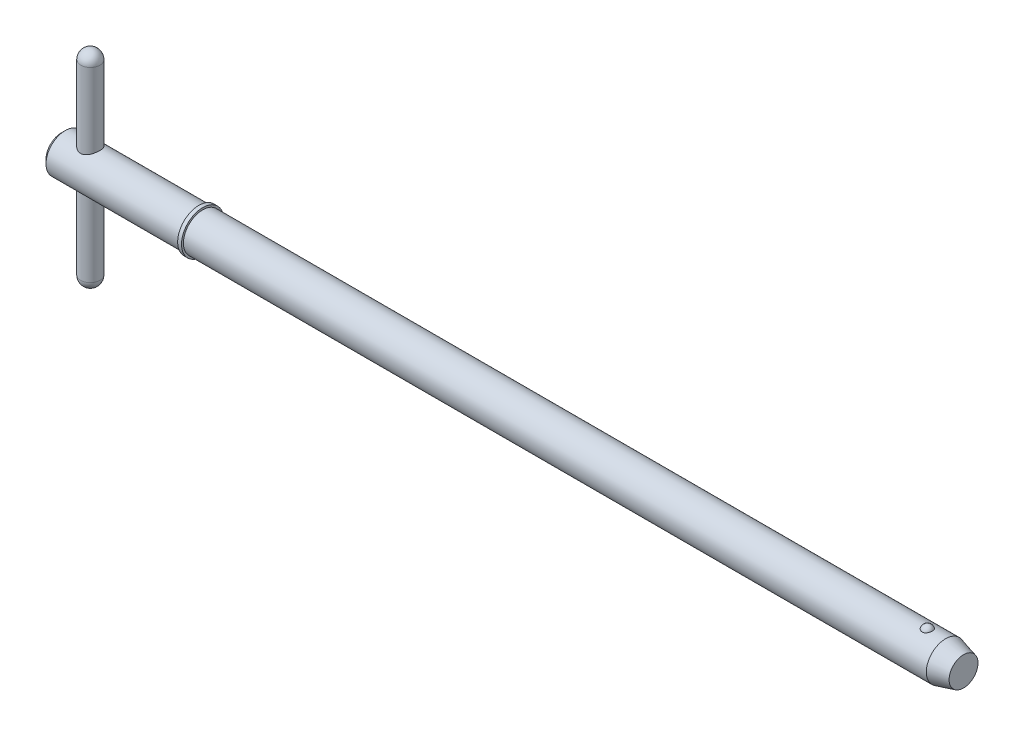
ISO-10303-21;
HEADER;
FILE_DESCRIPTION(('STEP AP214'),'2;1');
FILE_NAME('part.step','',(''),(''),'','','');
FILE_SCHEMA(('AUTOMOTIVE_DESIGN { 1 0 10303 214 1 1 1 1 }'));
ENDSEC;
DATA;
#1=APPLICATION_CONTEXT('core data for automotive mechanical design processes');
#2=APPLICATION_PROTOCOL_DEFINITION('international standard','automotive_design',2000,#1);
#3=PRODUCT_CONTEXT('',#1,'mechanical');
#4=PRODUCT('Part','Part','',(#3));
#5=PRODUCT_RELATED_PRODUCT_CATEGORY('part','',(#4));
#6=PRODUCT_DEFINITION_FORMATION('','',#4);
#7=PRODUCT_DEFINITION_CONTEXT('part definition',#1,'design');
#8=PRODUCT_DEFINITION('design','',#6,#7);
#9=PRODUCT_DEFINITION_SHAPE('','',#8);
#10=(LENGTH_UNIT() NAMED_UNIT(*) SI_UNIT(.MILLI.,.METRE.));
#11=(NAMED_UNIT(*) PLANE_ANGLE_UNIT() SI_UNIT($,.RADIAN.));
#12=(NAMED_UNIT(*) SI_UNIT($,.STERADIAN.) SOLID_ANGLE_UNIT());
#13=UNCERTAINTY_MEASURE_WITH_UNIT(LENGTH_MEASURE(1.E-05),#10,'distance_accuracy_value','');
#14=(GEOMETRIC_REPRESENTATION_CONTEXT(3) GLOBAL_UNCERTAINTY_ASSIGNED_CONTEXT((#13)) GLOBAL_UNIT_ASSIGNED_CONTEXT((#10,
#11,#12)) REPRESENTATION_CONTEXT('',''));
#15=CARTESIAN_POINT('',(0.,0.,0.));
#16=DIRECTION('',(0.,0.,1.));
#17=DIRECTION('',(1.,0.,0.));
#18=AXIS2_PLACEMENT_3D('',#15,#16,#17);
#19=CARTESIAN_POINT('',(3.57,12.7,0.));
#20=DIRECTION('',(0.,-1.,0.));
#21=DIRECTION('',(0.,0.,-1.));
#22=AXIS2_PLACEMENT_3D('',#19,#20,#21);
#23=CYLINDRICAL_SURFACE('',#22,1.19);
#24=CARTESIAN_POINT('',(3.57,-11.51,0.));
#25=DIRECTION('',(0.,-1.,0.));
#26=DIRECTION('',(0.,0.,-1.));
#27=AXIS2_PLACEMENT_3D('',#24,#25,#26);
#28=CIRCLE('',#27,1.19);
#29=CARTESIAN_POINT('',(3.57,-11.51,-1.19));
#30=VERTEX_POINT('',#29);
#31=EDGE_CURVE('P0_E10',#30,#30,#28,.F.);
#32=ORIENTED_EDGE('',*,*,#31,.T.);
#33=EDGE_LOOP('',(#32));
#34=FACE_BOUND('',#33,.T.);
#35=CARTESIAN_POINT('',(3.57,11.51,0.));
#36=DIRECTION('',(0.,-1.,0.));
#37=DIRECTION('',(0.,0.,-1.));
#38=AXIS2_PLACEMENT_3D('',#35,#36,#37);
#39=CIRCLE('',#38,1.19);
#40=CARTESIAN_POINT('',(3.57,11.51,-1.19));
#41=VERTEX_POINT('',#40);
#42=EDGE_CURVE('P0_E21',#41,#41,#39,.T.);
#43=ORIENTED_EDGE('',*,*,#42,.T.);
#44=EDGE_LOOP('',(#43));
#45=FACE_BOUND('',#44,.T.);
#46=ADVANCED_FACE('P0_F14',(#34,#45),#23,.T.);
#47=CARTESIAN_POINT('',(3.57,-11.51,0.));
#48=DIRECTION('',(0.,0.,1.));
#49=DIRECTION('',(1.,0.,0.));
#50=AXIS2_PLACEMENT_3D('',#47,#48,#49);
#51=SPHERICAL_SURFACE('',#50,1.19);
#52=CARTESIAN_POINT('',(3.57,-11.51,0.));
#53=DIRECTION('',(0.,-1.,0.));
#54=DIRECTION('',(0.,0.,-1.));
#55=AXIS2_PLACEMENT_3D('',#52,#53,#54);
#56=SPHERICAL_SURFACE('',#55,1.19);
#57=ORIENTED_EDGE('',*,*,#31,.F.);
#58=EDGE_LOOP('',(#57));
#59=FACE_BOUND('',#58,.T.);
#60=ADVANCED_FACE('P0_F29',(#59),#56,.T.);
#61=CARTESIAN_POINT('',(3.57,11.51,0.));
#62=DIRECTION('',(0.,0.,1.));
#63=DIRECTION('',(1.,0.,0.));
#64=AXIS2_PLACEMENT_3D('',#61,#62,#63);
#65=SPHERICAL_SURFACE('',#64,1.19);
#66=CARTESIAN_POINT('',(3.57,11.51,0.));
#67=DIRECTION('',(0.,-1.,0.));
#68=DIRECTION('',(0.,0.,-1.));
#69=AXIS2_PLACEMENT_3D('',#66,#67,#68);
#70=SPHERICAL_SURFACE('',#69,1.19);
#71=ORIENTED_EDGE('',*,*,#42,.F.);
#72=EDGE_LOOP('',(#71));
#73=FACE_BOUND('',#72,.T.);
#74=ADVANCED_FACE('P0_F16',(#73),#70,.T.);
#75=CLOSED_SHELL('',(#46,#60,#74));
#76=MANIFOLD_SOLID_BREP('P0_B1',#75);
#77=CARTESIAN_POINT('',(0.,0.,0.));
#78=DIRECTION('',(1.,0.,0.));
#79=DIRECTION('',(0.,0.,-1.));
#80=AXIS2_PLACEMENT_3D('',#77,#78,#79);
#81=CYLINDRICAL_SURFACE('',#80,2.38);
#82=CARTESIAN_POINT('',(109.209429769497,0.,0.));
#83=DIRECTION('',(1.,0.,0.));
#84=DIRECTION('',(0.,0.,-1.));
#85=AXIS2_PLACEMENT_3D('',#82,#83,#84);
#86=CIRCLE('',#85,2.38);
#87=CARTESIAN_POINT('',(109.209429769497,0.,-2.38));
#88=VERTEX_POINT('',#87);
#89=EDGE_CURVE('P1_E81',#88,#88,#86,.T.);
#90=ORIENTED_EDGE('',*,*,#89,.F.);
#91=EDGE_LOOP('',(#90));
#92=FACE_BOUND('',#91,.T.);
#93=CARTESIAN_POINT('',(17.45,0.,0.));
#94=DIRECTION('',(1.,0.,0.));
#95=DIRECTION('',(0.,0.,-1.));
#96=AXIS2_PLACEMENT_3D('',#93,#94,#95);
#97=CIRCLE('',#96,2.38);
#98=CARTESIAN_POINT('',(17.45,0.,-2.38));
#99=VERTEX_POINT('',#98);
#100=EDGE_CURVE('P1_E85',#99,#99,#97,.T.);
#101=ORIENTED_EDGE('',*,*,#100,.T.);
#102=EDGE_LOOP('',(#101));
#103=FACE_BOUND('',#102,.T.);
#104=CARTESIAN_POINT('',(106.963449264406,2.2921568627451,0.640637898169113));
#105=CARTESIAN_POINT('',(106.930355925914,2.29215737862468,0.64063719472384));
#106=CARTESIAN_POINT('',(106.897254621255,2.29293179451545,0.637884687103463));
#107=CARTESIAN_POINT('',(106.832017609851,2.29594030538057,0.626968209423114));
#108=CARTESIAN_POINT('',(106.799882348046,2.29817506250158,0.618801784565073));
#109=CARTESIAN_POINT('',(106.737540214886,2.3038430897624,0.597351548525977));
#110=CARTESIAN_POINT('',(106.70733051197,2.30727454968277,0.584075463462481));
#111=CARTESIAN_POINT('',(106.649567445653,2.31495941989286,0.552829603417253));
#112=CARTESIAN_POINT('',(106.62201418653,2.31921286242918,0.534859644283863));
#113=CARTESIAN_POINT('',(106.569593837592,2.32820213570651,0.494282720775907));
#114=CARTESIAN_POINT('',(106.544805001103,2.33294694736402,0.471576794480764));
#115=CARTESIAN_POINT('',(106.499216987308,2.34234144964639,0.422446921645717));
#116=CARTESIAN_POINT('',(106.478418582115,2.34699112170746,0.396022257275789));
#117=CARTESIAN_POINT('',(106.44035804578,2.35593942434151,0.33885587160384));
#118=CARTESIAN_POINT('',(106.423305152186,2.36021170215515,0.307970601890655));
#119=CARTESIAN_POINT('',(106.3943607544,2.3677057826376,0.243750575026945));
#120=CARTESIAN_POINT('',(106.3824701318,2.37092740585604,0.210415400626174));
#121=CARTESIAN_POINT('',(106.363807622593,2.37606901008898,0.141189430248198));
#122=CARTESIAN_POINT('',(106.357195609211,2.37794816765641,0.105252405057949));
#123=CARTESIAN_POINT('',(106.349809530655,2.38005135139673,0.0327351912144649));
#124=CARTESIAN_POINT('',(106.349035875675,2.38027526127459,-0.00384504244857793));
#125=CARTESIAN_POINT('',(106.353362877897,2.37903842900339,-0.0769838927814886));
#126=CARTESIAN_POINT('',(106.35852028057,2.37756141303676,-0.113538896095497));
#127=CARTESIAN_POINT('',(106.374701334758,2.37305303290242,-0.185229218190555));
#128=CARTESIAN_POINT('',(106.385725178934,2.37002161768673,-0.220364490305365));
#129=CARTESIAN_POINT('',(106.413397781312,2.36273722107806,-0.288156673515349));
#130=CARTESIAN_POINT('',(106.430038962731,2.35848588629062,-0.320816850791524));
#131=CARTESIAN_POINT('',(106.468598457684,2.34923130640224,-0.382744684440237));
#132=CARTESIAN_POINT('',(106.490516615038,2.34422808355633,-0.412012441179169));
#133=CARTESIAN_POINT('',(106.538754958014,2.33412555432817,-0.465830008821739));
#134=CARTESIAN_POINT('',(106.565002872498,2.32902887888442,-0.490444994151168));
#135=CARTESIAN_POINT('',(106.621476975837,2.31926941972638,-0.534700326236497));
#136=CARTESIAN_POINT('',(106.651702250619,2.3146065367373,-0.554341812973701));
#137=CARTESIAN_POINT('',(106.714061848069,2.30645675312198,-0.587312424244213));
#138=CARTESIAN_POINT('',(106.746078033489,2.30293152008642,-0.600855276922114));
#139=CARTESIAN_POINT('',(106.812079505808,2.29725171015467,-0.622220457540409));
#140=CARTESIAN_POINT('',(106.846064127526,2.29509667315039,-0.630044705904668));
#141=CARTESIAN_POINT('',(106.913299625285,2.29249264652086,-0.639452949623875));
#142=CARTESIAN_POINT('',(106.946508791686,2.29196755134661,-0.641315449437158));
#143=CARTESIAN_POINT('',(107.012763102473,2.29246849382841,-0.63952261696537));
#144=CARTESIAN_POINT('',(107.045808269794,2.29349430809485,-0.635868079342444));
#145=CARTESIAN_POINT('',(107.110102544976,2.29694059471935,-0.623301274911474));
#146=CARTESIAN_POINT('',(107.141374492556,2.29933234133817,-0.614497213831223));
#147=CARTESIAN_POINT('',(107.201995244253,2.30522511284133,-0.592006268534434));
#148=CARTESIAN_POINT('',(107.231343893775,2.30872622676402,-0.578318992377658));
#149=CARTESIAN_POINT('',(107.288036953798,2.31655795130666,-0.546112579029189));
#150=CARTESIAN_POINT('',(107.315320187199,2.32090569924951,-0.52749010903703));
#151=CARTESIAN_POINT('',(107.366490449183,2.3299220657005,-0.486117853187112));
#152=CARTESIAN_POINT('',(107.390376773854,2.33459075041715,-0.463367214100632));
#153=CARTESIAN_POINT('',(107.435272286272,2.34399834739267,-0.41322006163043));
#154=CARTESIAN_POINT('',(107.456097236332,2.34873051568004,-0.38565730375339));
#155=CARTESIAN_POINT('',(107.493056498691,2.35754932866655,-0.327455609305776));
#156=CARTESIAN_POINT('',(107.509189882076,2.36163584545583,-0.296816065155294));
#157=CARTESIAN_POINT('',(107.5369822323,2.36889321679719,-0.232047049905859));
#158=CARTESIAN_POINT('',(107.548445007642,2.37202275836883,-0.197828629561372));
#159=CARTESIAN_POINT('',(107.565752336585,2.37681926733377,-0.127900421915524));
#160=CARTESIAN_POINT('',(107.571596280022,2.37848607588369,-0.092190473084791));
#161=CARTESIAN_POINT('',(107.577605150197,2.38020024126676,-0.0196348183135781));
#162=CARTESIAN_POINT('',(107.57767043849,2.38021918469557,0.0172198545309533));
#163=CARTESIAN_POINT('',(107.571868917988,2.37856356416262,0.0904219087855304));
#164=CARTESIAN_POINT('',(107.566001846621,2.37688892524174,0.126769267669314));
#165=CARTESIAN_POINT('',(107.548425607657,2.37201688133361,0.198028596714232));
#166=CARTESIAN_POINT('',(107.536699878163,2.36881516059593,0.232936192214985));
#167=CARTESIAN_POINT('',(107.50763544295,2.36123444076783,0.300196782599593));
#168=CARTESIAN_POINT('',(107.490296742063,2.3568554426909,0.332549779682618));
#169=CARTESIAN_POINT('',(107.450535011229,2.34744667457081,0.39349541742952));
#170=CARTESIAN_POINT('',(107.428152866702,2.34242227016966,0.422115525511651));
#171=CARTESIAN_POINT('',(107.378739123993,2.33227293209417,0.475004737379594));
#172=CARTESIAN_POINT('',(107.351707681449,2.32714800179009,0.499273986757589));
#173=CARTESIAN_POINT('',(107.294498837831,2.31755359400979,0.542046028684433));
#174=CARTESIAN_POINT('',(107.26442973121,2.3130698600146,0.560690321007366));
#175=CARTESIAN_POINT('',(107.201386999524,2.30514125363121,0.592447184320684));
#176=CARTESIAN_POINT('',(107.168415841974,2.30169550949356,0.605564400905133));
#177=CARTESIAN_POINT('',(107.106842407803,2.29677744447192,0.623927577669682));
#178=CARTESIAN_POINT('',(107.078555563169,2.295058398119,0.630178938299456));
#179=CARTESIAN_POINT('',(107.021330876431,2.29274795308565,0.638534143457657));
#180=CARTESIAN_POINT('',(106.992393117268,2.29215641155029,0.640638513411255));
#181=CARTESIAN_POINT('',(106.963449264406,2.2921568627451,0.640637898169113));
#182=B_SPLINE_CURVE_WITH_KNOTS('',3,(#104,#105,#106,#107,#108,#109,#110,#111,#112,#113,#114,
#115,#116,#117,#118,#119,#120,#121,#122,#123,#124,#125,#126,#127,#128,#129,#130,#131,#132,#133,
#134,#135,#136,#137,#138,#139,#140,#141,#142,#143,#144,#145,#146,#147,#148,#149,#150,#151,#152,
#153,#154,#155,#156,#157,#158,#159,#160,#161,#162,#163,#164,#165,#166,#167,#168,#169,#170,#171,
#172,#173,#174,#175,#176,#177,#178,#179,#180,#181),.UNSPECIFIED.,.T.,.F.,(4,2,2,2,2,2,2,2,2,2,2,
2,2,2,2,2,2,2,2,2,2,2,2,2,2,2,2,2,2,2,2,2,2,2,2,2,2,2,4),(0.,0.0991724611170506,
0.198389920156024,0.297457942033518,0.396529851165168,0.497927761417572,0.59934527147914,
0.705475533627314,0.811623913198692,0.920876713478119,1.03013718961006,1.14045177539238,
1.25076998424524,1.36093998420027,1.47110672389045,1.57959248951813,1.68805336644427,
1.79234266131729,1.89659691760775,1.9959039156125,2.09519661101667,2.19247425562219,
2.2897597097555,2.38926978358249,2.48880044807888,2.59293588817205,2.69709193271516,
2.80525821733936,2.91343624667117,3.0234791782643,3.13352698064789,3.24388765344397,
3.35424823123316,3.46374443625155,3.5732369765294,3.67968690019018,3.78604717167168,
3.87279565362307,3.9595331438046),.UNSPECIFIED.);
#183=CARTESIAN_POINT('',(106.963449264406,2.2921568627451,0.640637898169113));
#184=VERTEX_POINT('',#183);
#185=EDGE_CURVE('P1_E35',#184,#184,#182,.T.);
#186=ORIENTED_EDGE('',*,*,#185,.T.);
#187=EDGE_LOOP('',(#186));
#188=FACE_BOUND('',#187,.T.);
#189=ADVANCED_FACE('P1_F13',(#92,#103,#188),#81,.T.);
#190=CARTESIAN_POINT('',(0.,0.,0.));
#191=DIRECTION('',(-1.,0.,0.));
#192=DIRECTION('',(0.,0.,1.));
#193=AXIS2_PLACEMENT_3D('',#190,#191,#192);
#194=PLANE('',#193);
#195=CARTESIAN_POINT('',(0.,0.,0.));
#196=DIRECTION('',(1.,0.,0.));
#197=DIRECTION('',(0.,0.,-1.));
#198=AXIS2_PLACEMENT_3D('',#195,#196,#197);
#199=CIRCLE('',#198,1.904);
#200=CARTESIAN_POINT('',(0.,0.,-1.904));
#201=VERTEX_POINT('',#200);
#202=EDGE_CURVE('P1_E9',#201,#201,#199,.T.);
#203=ORIENTED_EDGE('',*,*,#202,.F.);
#204=EDGE_LOOP('',(#203));
#205=FACE_BOUND('',#204,.T.);
#206=ADVANCED_FACE('P1_F15',(#205),#194,.T.);
#207=CARTESIAN_POINT('',(0.475999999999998,0.,0.));
#208=DIRECTION('',(1.,0.,0.));
#209=DIRECTION('',(0.,0.,-1.));
#210=AXIS2_PLACEMENT_3D('',#207,#208,#209);
#211=CONICAL_SURFACE('',#210,2.38,0.78539816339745);
#212=ORIENTED_EDGE('',*,*,#202,.T.);
#213=EDGE_LOOP('',(#212));
#214=FACE_BOUND('',#213,.T.);
#215=CARTESIAN_POINT('',(0.475999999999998,0.,0.));
#216=DIRECTION('',(1.,0.,0.));
#217=DIRECTION('',(0.,0.,-1.));
#218=AXIS2_PLACEMENT_3D('',#215,#216,#217);
#219=CIRCLE('',#218,2.38);
#220=CARTESIAN_POINT('',(0.475999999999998,0.,-2.38));
#221=VERTEX_POINT('',#220);
#222=EDGE_CURVE('P1_E26',#221,#221,#219,.T.);
#223=ORIENTED_EDGE('',*,*,#222,.F.);
#224=EDGE_LOOP('',(#223));
#225=FACE_BOUND('',#224,.T.);
#226=ADVANCED_FACE('P1_F77',(#214,#225),#211,.T.);
#227=CARTESIAN_POINT('',(0.,0.,0.));
#228=DIRECTION('',(1.,0.,0.));
#229=DIRECTION('',(0.,0.,-1.));
#230=AXIS2_PLACEMENT_3D('',#227,#228,#229);
#231=CYLINDRICAL_SURFACE('',#230,2.38);
#232=CARTESIAN_POINT('',(3.57,-2.06114046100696,1.19));
#233=CARTESIAN_POINT('',(3.50799170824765,-2.06114586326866,1.18999567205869));
#234=CARTESIAN_POINT('',(3.4459051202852,-2.0639812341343,1.18512096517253));
#235=CARTESIAN_POINT('',(3.32363755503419,-2.07491216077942,1.16587061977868));
#236=CARTESIAN_POINT('',(3.26346086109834,-2.08301876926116,1.15147501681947));
#237=CARTESIAN_POINT('',(3.14701251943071,-2.10331722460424,1.11395893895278));
#238=CARTESIAN_POINT('',(3.09072196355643,-2.1154873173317,1.09088484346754));
#239=CARTESIAN_POINT('',(2.9828251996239,-2.14250771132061,1.03680835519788));
#240=CARTESIAN_POINT('',(2.93121924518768,-2.15735815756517,1.00580553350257));
#241=CARTESIAN_POINT('',(2.82945618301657,-2.18956274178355,0.933753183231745));
#242=CARTESIAN_POINT('',(2.77976962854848,-2.20702235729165,0.892085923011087));
#243=CARTESIAN_POINT('',(2.68772401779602,-2.2416265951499,0.801172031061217));
#244=CARTESIAN_POINT('',(2.64536861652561,-2.25877105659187,0.751921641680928));
#245=CARTESIAN_POINT('',(2.56639309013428,-2.29219557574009,0.64318258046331));
#246=CARTESIAN_POINT('',(2.53035201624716,-2.30833946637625,0.583227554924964));
#247=CARTESIAN_POINT('',(2.46908238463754,-2.3365739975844,0.45714686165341));
#248=CARTESIAN_POINT('',(2.44384700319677,-2.34866719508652,0.391025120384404));
#249=CARTESIAN_POINT('',(2.40676945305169,-2.36667748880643,0.259473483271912));
#250=CARTESIAN_POINT('',(2.39410206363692,-2.37297281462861,0.194329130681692));
#251=CARTESIAN_POINT('',(2.3798023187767,-2.3800902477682,0.0625590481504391));
#252=CARTESIAN_POINT('',(2.37816328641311,-2.38091566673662,-0.00406576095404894));
#253=CARTESIAN_POINT('',(2.38564854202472,-2.37717948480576,-0.130700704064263));
#254=CARTESIAN_POINT('',(2.39384923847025,-2.37308010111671,-0.190782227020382));
#255=CARTESIAN_POINT('',(2.41912820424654,-2.360653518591,-0.308583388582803));
#256=CARTESIAN_POINT('',(2.43620713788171,-2.35232600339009,-0.366302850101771));
#257=CARTESIAN_POINT('',(2.47886825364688,-2.33206184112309,-0.478748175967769));
#258=CARTESIAN_POINT('',(2.50456481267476,-2.32007685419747,-0.533421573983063));
#259=CARTESIAN_POINT('',(2.56357346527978,-2.29357798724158,-0.637812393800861));
#260=CARTESIAN_POINT('',(2.5968882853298,-2.27906320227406,-0.687528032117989));
#261=CARTESIAN_POINT('',(2.67380546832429,-2.24724829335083,-0.785606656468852));
#262=CARTESIAN_POINT('',(2.71808260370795,-2.22981457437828,-0.833397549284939));
#263=CARTESIAN_POINT('',(2.81386177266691,-2.19500665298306,-0.921184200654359));
#264=CARTESIAN_POINT('',(2.86536931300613,-2.17763250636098,-0.961173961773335));
#265=CARTESIAN_POINT('',(2.97815134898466,-2.14371545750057,-1.03471134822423));
#266=CARTESIAN_POINT('',(3.03983836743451,-2.12729540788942,-1.06768860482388));
#267=CARTESIAN_POINT('',(3.16889582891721,-2.09886785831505,-1.12254974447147));
#268=CARTESIAN_POINT('',(3.2362602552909,-2.0868557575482,-1.14444520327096));
#269=CARTESIAN_POINT('',(3.36914526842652,-2.06994116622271,-1.1747444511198));
#270=CARTESIAN_POINT('',(3.43438893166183,-2.06455070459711,-1.18407989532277));
#271=CARTESIAN_POINT('',(3.56571759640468,-2.06010324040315,-1.1918051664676));
#272=CARTESIAN_POINT('',(3.63180197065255,-2.06104176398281,-1.19020272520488));
#273=CARTESIAN_POINT('',(3.75522816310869,-2.06862860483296,-1.17695289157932));
#274=CARTESIAN_POINT('',(3.81273554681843,-2.07464109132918,-1.16642350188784));
#275=CARTESIAN_POINT('',(3.92505766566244,-2.09075885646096,-1.1372785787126));
#276=CARTESIAN_POINT('',(3.97987152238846,-2.1008654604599,-1.1186604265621));
#277=CARTESIAN_POINT('',(4.08813948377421,-2.12458104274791,-1.07296063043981));
#278=CARTESIAN_POINT('',(4.14141303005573,-2.13833055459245,-1.04552693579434));
#279=CARTESIAN_POINT('',(4.2429084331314,-2.16765782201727,-0.983281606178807));
#280=CARTESIAN_POINT('',(4.29112767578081,-2.18323651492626,-0.948466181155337));
#281=CARTESIAN_POINT('',(4.38750473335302,-2.2168271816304,-0.867316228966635));
#282=CARTESIAN_POINT('',(4.43488860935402,-2.23489833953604,-0.82008287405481));
#283=CARTESIAN_POINT('',(4.52130056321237,-2.26973739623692,-0.718051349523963));
#284=CARTESIAN_POINT('',(4.56032581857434,-2.28650485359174,-0.663250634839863));
#285=CARTESIAN_POINT('',(4.62978273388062,-2.31742220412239,-0.545657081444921));
#286=CARTESIAN_POINT('',(4.65996041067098,-2.33149133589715,-0.482691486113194));
#287=CARTESIAN_POINT('',(4.7089941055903,-2.35481192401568,-0.351671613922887));
#288=CARTESIAN_POINT('',(4.7278600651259,-2.36406760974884,-0.283621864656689));
#289=CARTESIAN_POINT('',(4.75210859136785,-2.3760433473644,-0.151105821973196));
#290=CARTESIAN_POINT('',(4.75856947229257,-2.37928514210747,-0.0868836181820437));
#291=CARTESIAN_POINT('',(4.76100348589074,-2.38050135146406,0.0417999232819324));
#292=CARTESIAN_POINT('',(4.75698028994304,-2.37847760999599,0.106261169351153));
#293=CARTESIAN_POINT('',(4.73927447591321,-2.36969422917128,0.229120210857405));
#294=CARTESIAN_POINT('',(4.72624582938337,-2.36325544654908,0.287637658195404));
#295=CARTESIAN_POINT('',(4.69178087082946,-2.34658591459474,0.401560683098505));
#296=CARTESIAN_POINT('',(4.67034335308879,-2.33635462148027,0.456965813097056));
#297=CARTESIAN_POINT('',(4.61871480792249,-2.31247857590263,0.565753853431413));
#298=CARTESIAN_POINT('',(4.58818860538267,-2.29870654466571,0.618948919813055));
#299=CARTESIAN_POINT('',(4.51967006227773,-2.26918878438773,0.719681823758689));
#300=CARTESIAN_POINT('',(4.48167429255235,-2.25344215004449,0.76721704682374));
#301=CARTESIAN_POINT('',(4.39491140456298,-2.21969046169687,0.860267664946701));
#302=CARTESIAN_POINT('',(4.34544863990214,-2.20161660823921,0.905111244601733));
#303=CARTESIAN_POINT('',(4.23943364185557,-2.16655060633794,0.986109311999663));
#304=CARTESIAN_POINT('',(4.18287520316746,-2.1495594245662,1.02225611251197));
#305=CARTESIAN_POINT('',(4.06190239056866,-2.1181953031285,1.08579298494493));
#306=CARTESIAN_POINT('',(3.9972962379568,-2.10392207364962,1.11287022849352));
#307=CARTESIAN_POINT('',(3.86353443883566,-2.08090726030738,1.15534566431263));
#308=CARTESIAN_POINT('',(3.7943948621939,-2.07214719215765,1.17078291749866));
#309=CARTESIAN_POINT('',(3.69875162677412,-2.06499834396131,1.18329673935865));
#310=CARTESIAN_POINT('',(3.67309220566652,-2.06355673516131,1.18580656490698));
#311=CARTESIAN_POINT('',(3.62162638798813,-2.06162663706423,1.18915915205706));
#312=CARTESIAN_POINT('',(3.59581998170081,-2.0611382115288,1.19000180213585));
#313=CARTESIAN_POINT('',(3.57,-2.06114046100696,1.19));
#314=B_SPLINE_CURVE_WITH_KNOTS('',3,(#232,#233,#234,#235,#236,#237,#238,#239,#240,#241,#242,
#243,#244,#245,#246,#247,#248,#249,#250,#251,#252,#253,#254,#255,#256,#257,#258,#259,#260,#261,
#262,#263,#264,#265,#266,#267,#268,#269,#270,#271,#272,#273,#274,#275,#276,#277,#278,#279,#280,
#281,#282,#283,#284,#285,#286,#287,#288,#289,#290,#291,#292,#293,#294,#295,#296,#297,#298,#299,
#300,#301,#302,#303,#304,#305,#306,#307,#308,#309,#310,#311,#312,#313),.UNSPECIFIED.,.T.,.F.,(4,
2,2,2,2,2,2,2,2,2,2,2,2,2,2,2,2,2,2,2,2,2,2,2,2,2,2,2,2,2,2,2,2,2,2,2,2,2,2,2,4),(0.,
0.185916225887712,0.372223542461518,0.557549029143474,0.742884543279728,0.943506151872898,
1.14422749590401,1.35847891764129,1.5725948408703,1.77147547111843,1.97023568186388,
2.15171156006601,2.33320101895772,2.51720146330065,2.70126786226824,2.902733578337,
3.10435357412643,3.31877721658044,3.53297641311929,3.73020126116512,3.92728670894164,
4.1028127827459,4.27839572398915,4.46211082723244,4.64592048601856,4.8529002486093,
5.0599497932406,5.27246375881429,5.48479067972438,5.67763601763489,5.87041383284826,
6.05048865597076,6.23058930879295,6.41839293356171,6.60628297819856,6.8128718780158,
7.01964271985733,7.2329479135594,7.44553408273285,7.52294360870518,7.60035831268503),.UNSPECIFIED.);
#315=CARTESIAN_POINT('',(3.57,-2.06114046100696,1.19));
#316=VERTEX_POINT('',#315);
#317=EDGE_CURVE('P1_E17',#316,#316,#314,.T.);
#318=ORIENTED_EDGE('',*,*,#317,.F.);
#319=EDGE_LOOP('',(#318));
#320=FACE_BOUND('',#319,.T.);
#321=CARTESIAN_POINT('',(3.57,2.06114046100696,1.19));
#322=CARTESIAN_POINT('',(3.63200829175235,2.06114586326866,1.18999567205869));
#323=CARTESIAN_POINT('',(3.6940948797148,2.0639812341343,1.18512096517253));
#324=CARTESIAN_POINT('',(3.81636244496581,2.07491216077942,1.16587061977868));
#325=CARTESIAN_POINT('',(3.87653913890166,2.08301876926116,1.15147501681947));
#326=CARTESIAN_POINT('',(3.99298748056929,2.10331722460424,1.11395893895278));
#327=CARTESIAN_POINT('',(4.04927803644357,2.1154873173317,1.09088484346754));
#328=CARTESIAN_POINT('',(4.1571748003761,2.14250771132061,1.03680835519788));
#329=CARTESIAN_POINT('',(4.20878075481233,2.15735815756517,1.00580553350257));
#330=CARTESIAN_POINT('',(4.31054381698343,2.18956274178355,0.933753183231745));
#331=CARTESIAN_POINT('',(4.36023037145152,2.20702235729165,0.892085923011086));
#332=CARTESIAN_POINT('',(4.45227598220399,2.2416265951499,0.801172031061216));
#333=CARTESIAN_POINT('',(4.49463138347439,2.25877105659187,0.751921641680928));
#334=CARTESIAN_POINT('',(4.57360690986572,2.29219557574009,0.643182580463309));
#335=CARTESIAN_POINT('',(4.60964798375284,2.30833946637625,0.583227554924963));
#336=CARTESIAN_POINT('',(4.67091761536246,2.3365739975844,0.457146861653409));
#337=CARTESIAN_POINT('',(4.69615299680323,2.34866719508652,0.391025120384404));
#338=CARTESIAN_POINT('',(4.73323054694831,2.36667748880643,0.259473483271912));
#339=CARTESIAN_POINT('',(4.74589793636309,2.37297281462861,0.194329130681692));
#340=CARTESIAN_POINT('',(4.7601976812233,2.3800902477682,0.0625590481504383));
#341=CARTESIAN_POINT('',(4.76183671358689,2.38091566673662,-0.00406576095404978));
#342=CARTESIAN_POINT('',(4.75435145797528,2.37717948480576,-0.130700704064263));
#343=CARTESIAN_POINT('',(4.74615076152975,2.37308010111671,-0.190782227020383));
#344=CARTESIAN_POINT('',(4.72087179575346,2.360653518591,-0.308583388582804));
#345=CARTESIAN_POINT('',(4.70379286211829,2.35232600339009,-0.366302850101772));
#346=CARTESIAN_POINT('',(4.66113174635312,2.33206184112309,-0.478748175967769));
#347=CARTESIAN_POINT('',(4.63543518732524,2.32007685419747,-0.533421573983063));
#348=CARTESIAN_POINT('',(4.57642653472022,2.29357798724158,-0.637812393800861));
#349=CARTESIAN_POINT('',(4.5431117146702,2.27906320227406,-0.687528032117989));
#350=CARTESIAN_POINT('',(4.46619453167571,2.24724829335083,-0.785606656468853));
#351=CARTESIAN_POINT('',(4.42191739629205,2.22981457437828,-0.83339754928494));
#352=CARTESIAN_POINT('',(4.32613822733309,2.19500665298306,-0.921184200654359));
#353=CARTESIAN_POINT('',(4.27463068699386,2.17763250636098,-0.961173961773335));
#354=CARTESIAN_POINT('',(4.16184865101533,2.14371545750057,-1.03471134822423));
#355=CARTESIAN_POINT('',(4.10016163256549,2.12729540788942,-1.06768860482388));
#356=CARTESIAN_POINT('',(3.97110417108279,2.09886785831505,-1.12254974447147));
#357=CARTESIAN_POINT('',(3.9037397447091,2.0868557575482,-1.14444520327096));
#358=CARTESIAN_POINT('',(3.77085473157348,2.06994116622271,-1.1747444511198));
#359=CARTESIAN_POINT('',(3.70561106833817,2.06455070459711,-1.18407989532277));
#360=CARTESIAN_POINT('',(3.57428240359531,2.06010324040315,-1.1918051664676));
#361=CARTESIAN_POINT('',(3.50819802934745,2.06104176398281,-1.19020272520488));
#362=CARTESIAN_POINT('',(3.38477183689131,2.06862860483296,-1.17695289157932));
#363=CARTESIAN_POINT('',(3.32726445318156,2.07464109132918,-1.16642350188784));
#364=CARTESIAN_POINT('',(3.21494233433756,2.09075885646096,-1.1372785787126));
#365=CARTESIAN_POINT('',(3.16012847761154,2.1008654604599,-1.1186604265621));
#366=CARTESIAN_POINT('',(3.05186051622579,2.12458104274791,-1.07296063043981));
#367=CARTESIAN_POINT('',(2.99858696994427,2.13833055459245,-1.04552693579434));
#368=CARTESIAN_POINT('',(2.8970915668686,2.16765782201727,-0.983281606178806));
#369=CARTESIAN_POINT('',(2.84887232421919,2.18323651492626,-0.948466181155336));
#370=CARTESIAN_POINT('',(2.75249526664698,2.2168271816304,-0.867316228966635));
#371=CARTESIAN_POINT('',(2.70511139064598,2.23489833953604,-0.820082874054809));
#372=CARTESIAN_POINT('',(2.61869943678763,2.26973739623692,-0.718051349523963));
#373=CARTESIAN_POINT('',(2.57967418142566,2.28650485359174,-0.663250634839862));
#374=CARTESIAN_POINT('',(2.51021726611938,2.31742220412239,-0.54565708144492));
#375=CARTESIAN_POINT('',(2.48003958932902,2.33149133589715,-0.482691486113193));
#376=CARTESIAN_POINT('',(2.4310058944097,2.35481192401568,-0.351671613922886));
#377=CARTESIAN_POINT('',(2.4121399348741,2.36406760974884,-0.283621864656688));
#378=CARTESIAN_POINT('',(2.38789140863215,2.3760433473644,-0.151105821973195));
#379=CARTESIAN_POINT('',(2.38143052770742,2.37928514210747,-0.0868836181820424));
#380=CARTESIAN_POINT('',(2.37899651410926,2.38050135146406,0.0417999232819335));
#381=CARTESIAN_POINT('',(2.38301971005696,2.37847760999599,0.106261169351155));
#382=CARTESIAN_POINT('',(2.40072552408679,2.36969422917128,0.229120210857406));
#383=CARTESIAN_POINT('',(2.41375417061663,2.36325544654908,0.287637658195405));
#384=CARTESIAN_POINT('',(2.44821912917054,2.34658591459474,0.401560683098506));
#385=CARTESIAN_POINT('',(2.46965664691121,2.33635462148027,0.456965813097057));
#386=CARTESIAN_POINT('',(2.52128519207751,2.31247857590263,0.565753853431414));
#387=CARTESIAN_POINT('',(2.55181139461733,2.29870654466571,0.618948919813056));
#388=CARTESIAN_POINT('',(2.62032993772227,2.26918878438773,0.719681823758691));
#389=CARTESIAN_POINT('',(2.65832570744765,2.25344215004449,0.767217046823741));
#390=CARTESIAN_POINT('',(2.74508859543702,2.21969046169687,0.860267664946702));
#391=CARTESIAN_POINT('',(2.79455136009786,2.20161660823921,0.905111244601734));
#392=CARTESIAN_POINT('',(2.90056635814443,2.16655060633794,0.986109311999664));
#393=CARTESIAN_POINT('',(2.95712479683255,2.1495594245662,1.02225611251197));
#394=CARTESIAN_POINT('',(3.07809760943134,2.1181953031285,1.08579298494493));
#395=CARTESIAN_POINT('',(3.1427037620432,2.10392207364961,1.11287022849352));
#396=CARTESIAN_POINT('',(3.27646556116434,2.08090726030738,1.15534566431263));
#397=CARTESIAN_POINT('',(3.3456051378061,2.07214719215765,1.17078291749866));
#398=CARTESIAN_POINT('',(3.44124837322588,2.06499834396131,1.18329673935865));
#399=CARTESIAN_POINT('',(3.46690779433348,2.06355673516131,1.18580656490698));
#400=CARTESIAN_POINT('',(3.51837361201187,2.06162663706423,1.18915915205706));
#401=CARTESIAN_POINT('',(3.54418001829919,2.0611382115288,1.19000180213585));
#402=CARTESIAN_POINT('',(3.57,2.06114046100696,1.19));
#403=B_SPLINE_CURVE_WITH_KNOTS('',3,(#321,#322,#323,#324,#325,#326,#327,#328,#329,#330,#331,
#332,#333,#334,#335,#336,#337,#338,#339,#340,#341,#342,#343,#344,#345,#346,#347,#348,#349,#350,
#351,#352,#353,#354,#355,#356,#357,#358,#359,#360,#361,#362,#363,#364,#365,#366,#367,#368,#369,
#370,#371,#372,#373,#374,#375,#376,#377,#378,#379,#380,#381,#382,#383,#384,#385,#386,#387,#388,
#389,#390,#391,#392,#393,#394,#395,#396,#397,#398,#399,#400,#401,#402),.UNSPECIFIED.,.T.,.F.,(4,
2,2,2,2,2,2,2,2,2,2,2,2,2,2,2,2,2,2,2,2,2,2,2,2,2,2,2,2,2,2,2,2,2,2,2,2,2,2,2,4),(0.,
0.185916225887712,0.372223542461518,0.557549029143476,0.74288454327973,0.9435061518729,
1.14422749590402,1.35847891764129,1.5725948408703,1.77147547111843,1.97023568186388,
2.15171156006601,2.33320101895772,2.51720146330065,2.70126786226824,2.902733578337,
3.10435357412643,3.31877721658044,3.53297641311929,3.73020126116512,3.92728670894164,
4.1028127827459,4.27839572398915,4.46211082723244,4.64592048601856,4.8529002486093,
5.05994979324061,5.27246375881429,5.48479067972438,5.67763601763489,5.87041383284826,
6.05048865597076,6.23058930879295,6.41839293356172,6.60628297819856,6.8128718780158,
7.01964271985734,7.2329479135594,7.44553408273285,7.52294360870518,7.60035831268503),.UNSPECIFIED.);
#404=CARTESIAN_POINT('',(3.57,2.06114046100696,1.19));
#405=VERTEX_POINT('',#404);
#406=EDGE_CURVE('P1_E43',#405,#405,#403,.T.);
#407=ORIENTED_EDGE('',*,*,#406,.F.);
#408=EDGE_LOOP('',(#407));
#409=FACE_BOUND('',#408,.T.);
#410=ORIENTED_EDGE('',*,*,#222,.T.);
#411=EDGE_LOOP('',(#410));
#412=FACE_BOUND('',#411,.T.);
#413=CARTESIAN_POINT('',(16.974,0.,0.));
#414=DIRECTION('',(1.,0.,0.));
#415=DIRECTION('',(0.,0.,-1.));
#416=AXIS2_PLACEMENT_3D('',#413,#414,#415);
#417=CIRCLE('',#416,2.38);
#418=CARTESIAN_POINT('',(16.974,0.,-2.38));
#419=VERTEX_POINT('',#418);
#420=EDGE_CURVE('P1_E31',#419,#419,#417,.T.);
#421=ORIENTED_EDGE('',*,*,#420,.F.);
#422=EDGE_LOOP('',(#421));
#423=FACE_BOUND('',#422,.T.);
#424=ADVANCED_FACE('P1_F103',(#320,#409,#412,#423),#231,.T.);
#425=CARTESIAN_POINT('',(16.974,2.38,0.));
#426=DIRECTION('',(-1.,0.,0.));
#427=DIRECTION('',(0.,0.,1.));
#428=AXIS2_PLACEMENT_3D('',#425,#426,#427);
#429=PLANE('',#428);
#430=ORIENTED_EDGE('',*,*,#420,.T.);
#431=EDGE_LOOP('',(#430));
#432=FACE_BOUND('',#431,.T.);
#433=CARTESIAN_POINT('',(16.974,0.,0.));
#434=DIRECTION('',(1.,0.,0.));
#435=DIRECTION('',(0.,0.,-1.));
#436=AXIS2_PLACEMENT_3D('',#433,#434,#435);
#437=CIRCLE('',#436,2.618);
#438=CARTESIAN_POINT('',(16.974,0.,-2.618));
#439=VERTEX_POINT('',#438);
#440=EDGE_CURVE('P1_E91',#439,#439,#437,.T.);
#441=ORIENTED_EDGE('',*,*,#440,.F.);
#442=EDGE_LOOP('',(#441));
#443=FACE_BOUND('',#442,.T.);
#444=ADVANCED_FACE('P1_F100',(#432,#443),#429,.T.);
#445=CARTESIAN_POINT('',(0.,0.,0.));
#446=DIRECTION('',(1.,0.,0.));
#447=DIRECTION('',(0.,0.,-1.));
#448=AXIS2_PLACEMENT_3D('',#445,#446,#447);
#449=CYLINDRICAL_SURFACE('',#448,2.618);
#450=ORIENTED_EDGE('',*,*,#440,.T.);
#451=EDGE_LOOP('',(#450));
#452=FACE_BOUND('',#451,.T.);
#453=CARTESIAN_POINT('',(17.45,0.,0.));
#454=DIRECTION('',(1.,0.,0.));
#455=DIRECTION('',(0.,0.,-1.));
#456=AXIS2_PLACEMENT_3D('',#453,#454,#455);
#457=CIRCLE('',#456,2.618);
#458=CARTESIAN_POINT('',(17.45,0.,-2.618));
#459=VERTEX_POINT('',#458);
#460=EDGE_CURVE('P1_E88',#459,#459,#457,.T.);
#461=ORIENTED_EDGE('',*,*,#460,.F.);
#462=EDGE_LOOP('',(#461));
#463=FACE_BOUND('',#462,.T.);
#464=ADVANCED_FACE('P1_F68',(#452,#463),#449,.T.);
#465=CARTESIAN_POINT('',(17.45,2.618,0.));
#466=DIRECTION('',(1.,0.,0.));
#467=DIRECTION('',(0.,0.,-1.));
#468=AXIS2_PLACEMENT_3D('',#465,#466,#467);
#469=PLANE('',#468);
#470=ORIENTED_EDGE('',*,*,#460,.T.);
#471=EDGE_LOOP('',(#470));
#472=FACE_BOUND('',#471,.T.);
#473=ORIENTED_EDGE('',*,*,#100,.F.);
#474=EDGE_LOOP('',(#473));
#475=FACE_BOUND('',#474,.T.);
#476=ADVANCED_FACE('P1_F62',(#472,#475),#469,.T.);
#477=CARTESIAN_POINT('',(111.43,0.,0.));
#478=DIRECTION('',(-1.,0.,0.));
#479=DIRECTION('',(0.,0.,1.));
#480=AXIS2_PLACEMENT_3D('',#477,#478,#479);
#481=CONICAL_SURFACE('',#480,1.78500000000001,0.261799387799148);
#482=ORIENTED_EDGE('',*,*,#89,.T.);
#483=EDGE_LOOP('',(#482));
#484=FACE_BOUND('',#483,.T.);
#485=CARTESIAN_POINT('',(111.43,0.,0.));
#486=DIRECTION('',(1.,0.,0.));
#487=DIRECTION('',(0.,0.,-1.));
#488=AXIS2_PLACEMENT_3D('',#485,#486,#487);
#489=CIRCLE('',#488,1.78500000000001);
#490=CARTESIAN_POINT('',(111.43,0.,-1.78500000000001));
#491=VERTEX_POINT('',#490);
#492=EDGE_CURVE('P1_E42',#491,#491,#489,.T.);
#493=ORIENTED_EDGE('',*,*,#492,.F.);
#494=EDGE_LOOP('',(#493));
#495=FACE_BOUND('',#494,.T.);
#496=ADVANCED_FACE('P1_F59',(#484,#495),#481,.T.);
#497=CARTESIAN_POINT('',(111.43,1.78500000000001,0.));
#498=DIRECTION('',(1.,0.,0.));
#499=DIRECTION('',(0.,0.,-1.));
#500=AXIS2_PLACEMENT_3D('',#497,#498,#499);
#501=PLANE('',#500);
#502=ORIENTED_EDGE('',*,*,#492,.T.);
#503=EDGE_LOOP('',(#502));
#504=FACE_BOUND('',#503,.T.);
#505=ADVANCED_FACE('P1_F55',(#504),#501,.T.);
#506=CARTESIAN_POINT('',(106.963449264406,2.142,0.));
#507=DIRECTION('',(-1.,0.,0.));
#508=DIRECTION('',(0.,1.,0.));
#509=AXIS2_PLACEMENT_3D('',#506,#507,#508);
#510=SPHERICAL_SURFACE('',#509,0.657999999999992);
#511=ORIENTED_EDGE('',*,*,#185,.F.);
#512=EDGE_LOOP('',(#511));
#513=FACE_BOUND('',#512,.T.);
#514=ADVANCED_FACE('P1_F50',(#513),#510,.T.);
#515=CARTESIAN_POINT('',(3.57,-2.618,0.));
#516=DIRECTION('',(0.,1.,0.));
#517=DIRECTION('',(0.,0.,1.));
#518=AXIS2_PLACEMENT_3D('',#515,#516,#517);
#519=CYLINDRICAL_SURFACE('',#518,1.19);
#520=ORIENTED_EDGE('',*,*,#317,.T.);
#521=EDGE_LOOP('',(#520));
#522=FACE_BOUND('',#521,.T.);
#523=ORIENTED_EDGE('',*,*,#406,.T.);
#524=EDGE_LOOP('',(#523));
#525=FACE_BOUND('',#524,.T.);
#526=ADVANCED_FACE('P1_F54',(#522,#525),#519,.F.);
#527=CLOSED_SHELL('',(#189,#206,#226,#424,#444,#464,#476,#496,#505,#514,#526));
#528=MANIFOLD_SOLID_BREP('P1_B1',#527);
#529=ADVANCED_BREP_SHAPE_REPRESENTATION('',(#18,#76,#528),#14);
#530=SHAPE_DEFINITION_REPRESENTATION(#9,#529);
ENDSEC;
END-ISO-10303-21;
